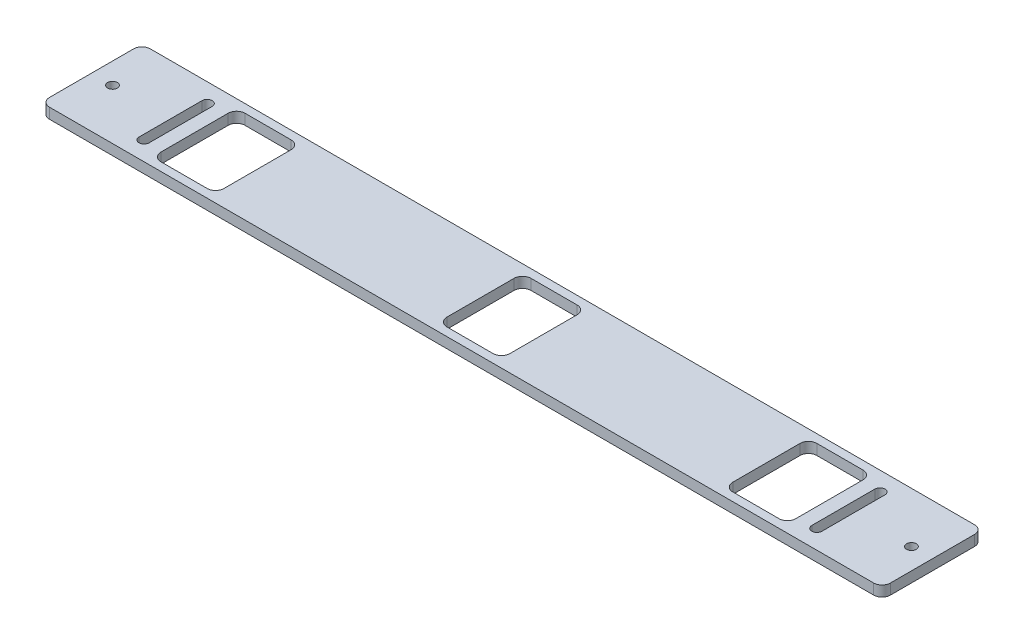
from build123d import *

# Parameters (mm, degrees)
SKETCH1_W             = 254
SKETCH1_H             = 30.48
SKETCH1_W_2           = 19.05
SKETCH1_H_2           = 25.4
BOSS_EXTRUDE1_DEPTH   = 3.175
FILLET1_R             = 2.54
F_4_CLEARANCE_HOLE1_D = 2.9464


with BuildPart() as part:
    # Sketch1 → Boss-Extrude1 (new body)
    with BuildSketch(Plane(origin=(0, 0, 0), x_dir=(1, 0, 0), z_dir=(0, 1, 0))):
        with Locations((127, 15.24)):
            Rectangle(SKETCH1_W, SKETCH1_H)
        with Locations((40.64, 15.24)):
            Rectangle(SKETCH1_W_2, SKETCH1_H_2, mode=Mode.SUBTRACT)
        with Locations((127, 15.24)):
            Rectangle(SKETCH1_W_2, SKETCH1_H_2, mode=Mode.SUBTRACT)
        with Locations((213.36, 15.24)):
            Rectangle(SKETCH1_W_2, SKETCH1_H_2, mode=Mode.SUBTRACT)
        with BuildLine():
            Line((23.876, 5.715), (23.876, 24.765))
            ThreePointArc((23.876, 24.765), (25.4, 26.289), (26.924, 24.765))
            Line((26.924, 24.765), (26.924, 5.715))
            ThreePointArc((26.924, 5.715), (25.4, 4.191), (23.876, 5.715))
        make_face(mode=Mode.SUBTRACT)
        with BuildLine():
            Line((230.124, 5.715), (230.124, 24.765))
            ThreePointArc((230.124, 24.765), (228.6, 26.289), (227.076, 24.765))
            Line((227.076, 24.765), (227.076, 5.715))
            ThreePointArc((227.076, 5.715), (228.6, 4.191), (230.124, 5.715))
        make_face(mode=Mode.SUBTRACT)
    extrude(amount=BOSS_EXTRUDE1_DEPTH)

    # Fillet1
    fillet1_edges = [part.edges().sort_by_distance(p)[0] for p in [
        (31.115, 1.5875, -27.94),
        (31.115, 1.5875, -2.54),
        (50.165, 1.5875, -2.54),
        (50.165, 1.5875, -27.94),
        (117.475, 1.5875, -27.94),
        (117.475, 1.5875, -2.54),
        (136.525, 1.5875, -2.54),
        (136.525, 1.5875, -27.94),
        (203.835, 1.5875, -27.94),
        (203.835, 1.5875, -2.54),
        (222.885, 1.5875, -2.54),
        (222.885, 1.5875, -27.94),
        (0, 1.5875, -30.48),
        (254, 1.5875, -30.48),
        (254, 1.5875, 0),
        (0, 1.5875, 0),
    ]]
    fillet(fillet1_edges, radius=FILLET1_R)

    # 4 Clearance Hole1 (through all)
    with Locations(Plane(origin=(0, 3.175, 0), x_dir=(1, 0, 0), z_dir=(0, 1, 0))):
        with Locations((6.35, 15.24), (247.65, 15.24)):
            Hole(F_4_CLEARANCE_HOLE1_D / 2)


solid = part.part
